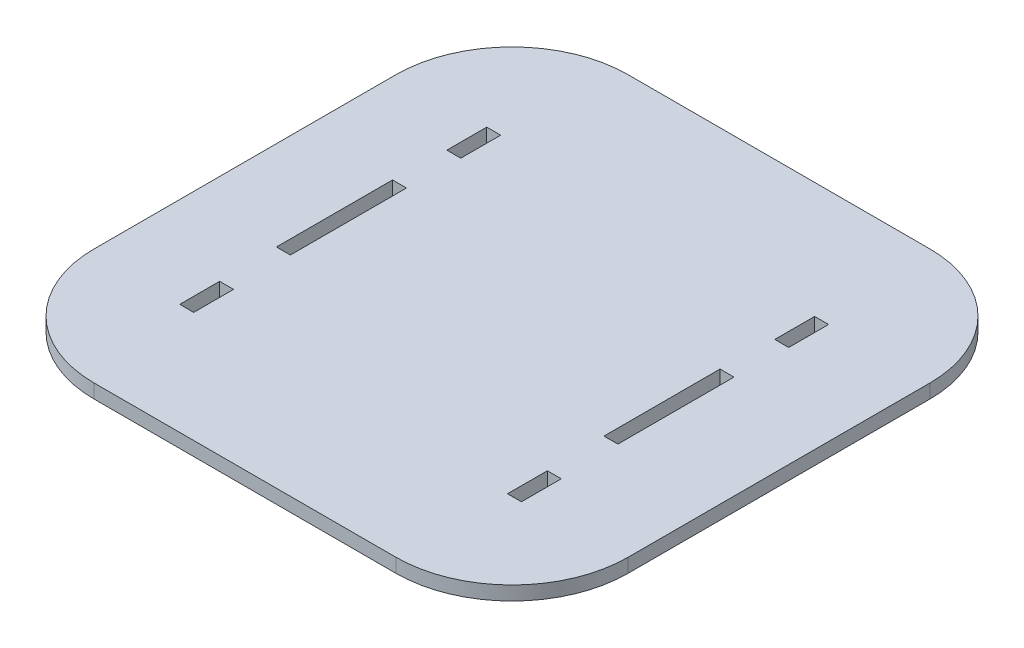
ISO-10303-21;
HEADER;
FILE_DESCRIPTION(('STEP AP214'),'2;1');
FILE_NAME('part.step','',(''),(''),'','','');
FILE_SCHEMA(('AUTOMOTIVE_DESIGN { 1 0 10303 214 1 1 1 1 }'));
ENDSEC;
DATA;
#1=APPLICATION_CONTEXT('core data for automotive mechanical design processes');
#2=APPLICATION_PROTOCOL_DEFINITION('international standard','automotive_design',2000,#1);
#3=PRODUCT_CONTEXT('',#1,'mechanical');
#4=PRODUCT('Part','Part','',(#3));
#5=PRODUCT_RELATED_PRODUCT_CATEGORY('part','',(#4));
#6=PRODUCT_DEFINITION_FORMATION('','',#4);
#7=PRODUCT_DEFINITION_CONTEXT('part definition',#1,'design');
#8=PRODUCT_DEFINITION('design','',#6,#7);
#9=PRODUCT_DEFINITION_SHAPE('','',#8);
#10=(LENGTH_UNIT() NAMED_UNIT(*) SI_UNIT(.MILLI.,.METRE.));
#11=(NAMED_UNIT(*) PLANE_ANGLE_UNIT() SI_UNIT($,.RADIAN.));
#12=(NAMED_UNIT(*) SI_UNIT($,.STERADIAN.) SOLID_ANGLE_UNIT());
#13=UNCERTAINTY_MEASURE_WITH_UNIT(LENGTH_MEASURE(1.E-05),#10,'distance_accuracy_value','');
#14=(GEOMETRIC_REPRESENTATION_CONTEXT(3) GLOBAL_UNCERTAINTY_ASSIGNED_CONTEXT((#13)) GLOBAL_UNIT_ASSIGNED_CONTEXT((#10,
#11,#12)) REPRESENTATION_CONTEXT('',''));
#15=CARTESIAN_POINT('',(0.,0.,0.));
#16=DIRECTION('',(0.,0.,1.));
#17=DIRECTION('',(1.,0.,0.));
#18=AXIS2_PLACEMENT_3D('',#15,#16,#17);
#19=CARTESIAN_POINT('',(61.2708053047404,12.,-315.446866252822));
#20=DIRECTION('',(0.,-1.,0.));
#21=DIRECTION('',(0.,0.,-1.));
#22=AXIS2_PLACEMENT_3D('',#19,#20,#21);
#23=CYLINDRICAL_SURFACE('',#22,100.);
#24=CARTESIAN_POINT('',(61.2708053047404,0.,-315.446866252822));
#25=DIRECTION('',(0.,1.,0.));
#26=DIRECTION('',(0.,0.,-1.));
#27=AXIS2_PLACEMENT_3D('',#24,#25,#26);
#28=CIRCLE('',#27,100.);
#29=CARTESIAN_POINT('',(61.2708053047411,0.,-415.446866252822));
#30=VERTEX_POINT('',#29);
#31=CARTESIAN_POINT('',(-38.7291946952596,0.,-315.446866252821));
#32=VERTEX_POINT('',#31);
#33=EDGE_CURVE('E437',#30,#32,#28,.T.);
#34=ORIENTED_EDGE('',*,*,#33,.T.);
#35=DIRECTION('',(0.,-1.,0.));
#36=VECTOR('',#35,1.);
#37=CARTESIAN_POINT('',(-38.7291946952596,12.,-315.446866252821));
#38=LINE('',#37,#36);
#39=CARTESIAN_POINT('',(-38.7291946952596,12.,-315.446866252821));
#40=VERTEX_POINT('',#39);
#41=EDGE_CURVE('E11',#40,#32,#38,.T.);
#42=ORIENTED_EDGE('',*,*,#41,.F.);
#43=CARTESIAN_POINT('',(61.2708053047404,12.,-315.446866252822));
#44=DIRECTION('',(0.,1.,0.));
#45=DIRECTION('',(0.,0.,-1.));
#46=AXIS2_PLACEMENT_3D('',#43,#44,#45);
#47=CIRCLE('',#46,100.);
#48=CARTESIAN_POINT('',(61.2708053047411,12.,-415.446866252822));
#49=VERTEX_POINT('',#48);
#50=EDGE_CURVE('E438',#49,#40,#47,.T.);
#51=ORIENTED_EDGE('',*,*,#50,.F.);
#52=DIRECTION('',(0.,-1.,0.));
#53=VECTOR('',#52,1.);
#54=CARTESIAN_POINT('',(61.2708053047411,12.,-415.446866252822));
#55=LINE('',#54,#53);
#56=EDGE_CURVE('E456',#49,#30,#55,.T.);
#57=ORIENTED_EDGE('',*,*,#56,.T.);
#58=EDGE_LOOP('',(#34,#42,#51,#57));
#59=FACE_BOUND('',#58,.T.);
#60=ADVANCED_FACE('F32',(#59),#23,.T.);
#61=CARTESIAN_POINT('',(-38.7291946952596,12.,-315.446866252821));
#62=DIRECTION('',(1.,0.,0.));
#63=DIRECTION('',(0.,0.,-1.));
#64=AXIS2_PLACEMENT_3D('',#61,#62,#63);
#65=PLANE('',#64);
#66=DIRECTION('',(0.,0.,1.));
#67=VECTOR('',#66,1.);
#68=CARTESIAN_POINT('',(-38.7291946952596,0.,-315.446866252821));
#69=LINE('',#68,#67);
#70=CARTESIAN_POINT('',(-38.7291946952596,0.,-55.4468662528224));
#71=VERTEX_POINT('',#70);
#72=EDGE_CURVE('E459',#32,#71,#69,.T.);
#73=ORIENTED_EDGE('',*,*,#72,.T.);
#74=DIRECTION('',(0.,-1.,0.));
#75=VECTOR('',#74,1.);
#76=CARTESIAN_POINT('',(-38.7291946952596,12.,-55.4468662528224));
#77=LINE('',#76,#75);
#78=CARTESIAN_POINT('',(-38.7291946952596,12.,-55.4468662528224));
#79=VERTEX_POINT('',#78);
#80=EDGE_CURVE('E39',#79,#71,#77,.T.);
#81=ORIENTED_EDGE('',*,*,#80,.F.);
#82=DIRECTION('',(0.,0.,1.));
#83=VECTOR('',#82,1.);
#84=CARTESIAN_POINT('',(-38.7291946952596,12.,-315.446866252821));
#85=LINE('',#84,#83);
#86=EDGE_CURVE('E441',#40,#79,#85,.T.);
#87=ORIENTED_EDGE('',*,*,#86,.F.);
#88=ORIENTED_EDGE('',*,*,#41,.T.);
#89=EDGE_LOOP('',(#73,#81,#87,#88));
#90=FACE_BOUND('',#89,.T.);
#91=ADVANCED_FACE('F515',(#90),#65,.F.);
#92=CARTESIAN_POINT('',(61.2708053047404,12.,-55.4468662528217));
#93=DIRECTION('',(0.,-1.,0.));
#94=DIRECTION('',(0.,0.,-1.));
#95=AXIS2_PLACEMENT_3D('',#92,#93,#94);
#96=CYLINDRICAL_SURFACE('',#95,100.);
#97=CARTESIAN_POINT('',(61.2708053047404,0.,-55.4468662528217));
#98=DIRECTION('',(0.,1.,0.));
#99=DIRECTION('',(0.,0.,-1.));
#100=AXIS2_PLACEMENT_3D('',#97,#98,#99);
#101=CIRCLE('',#100,100.);
#102=CARTESIAN_POINT('',(61.2708053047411,0.,44.5531337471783));
#103=VERTEX_POINT('',#102);
#104=EDGE_CURVE('E461',#71,#103,#101,.T.);
#105=ORIENTED_EDGE('',*,*,#104,.T.);
#106=DIRECTION('',(0.,-1.,0.));
#107=VECTOR('',#106,1.);
#108=CARTESIAN_POINT('',(61.2708053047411,12.,44.5531337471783));
#109=LINE('',#108,#107);
#110=CARTESIAN_POINT('',(61.2708053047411,12.,44.5531337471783));
#111=VERTEX_POINT('',#110);
#112=EDGE_CURVE('E486',#111,#103,#109,.T.);
#113=ORIENTED_EDGE('',*,*,#112,.F.);
#114=CARTESIAN_POINT('',(61.2708053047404,12.,-55.4468662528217));
#115=DIRECTION('',(0.,1.,0.));
#116=DIRECTION('',(0.,0.,-1.));
#117=AXIS2_PLACEMENT_3D('',#114,#115,#116);
#118=CIRCLE('',#117,100.);
#119=EDGE_CURVE('E444',#79,#111,#118,.T.);
#120=ORIENTED_EDGE('',*,*,#119,.F.);
#121=ORIENTED_EDGE('',*,*,#80,.T.);
#122=EDGE_LOOP('',(#105,#113,#120,#121));
#123=FACE_BOUND('',#122,.T.);
#124=ADVANCED_FACE('F493',(#123),#96,.T.);
#125=CARTESIAN_POINT('',(61.2708053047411,12.,44.5531337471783));
#126=DIRECTION('',(0.,0.,-1.));
#127=DIRECTION('',(-1.,0.,0.));
#128=AXIS2_PLACEMENT_3D('',#125,#126,#127);
#129=PLANE('',#128);
#130=DIRECTION('',(1.,0.,0.));
#131=VECTOR('',#130,1.);
#132=CARTESIAN_POINT('',(61.2708053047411,0.,44.5531337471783));
#133=LINE('',#132,#131);
#134=CARTESIAN_POINT('',(321.27080530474,0.,44.5531337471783));
#135=VERTEX_POINT('',#134);
#136=EDGE_CURVE('E463',#103,#135,#133,.T.);
#137=ORIENTED_EDGE('',*,*,#136,.T.);
#138=DIRECTION('',(0.,-1.,0.));
#139=VECTOR('',#138,1.);
#140=CARTESIAN_POINT('',(321.27080530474,12.,44.5531337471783));
#141=LINE('',#140,#139);
#142=CARTESIAN_POINT('',(321.27080530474,12.,44.5531337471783));
#143=VERTEX_POINT('',#142);
#144=EDGE_CURVE('E483',#143,#135,#141,.T.);
#145=ORIENTED_EDGE('',*,*,#144,.F.);
#146=DIRECTION('',(1.,0.,0.));
#147=VECTOR('',#146,1.);
#148=CARTESIAN_POINT('',(61.2708053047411,12.,44.5531337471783));
#149=LINE('',#148,#147);
#150=EDGE_CURVE('E446',#111,#143,#149,.T.);
#151=ORIENTED_EDGE('',*,*,#150,.F.);
#152=ORIENTED_EDGE('',*,*,#112,.T.);
#153=EDGE_LOOP('',(#137,#145,#151,#152));
#154=FACE_BOUND('',#153,.T.);
#155=ADVANCED_FACE('F503',(#154),#129,.F.);
#156=CARTESIAN_POINT('',(321.27080530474,12.,-55.4468662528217));
#157=DIRECTION('',(0.,-1.,0.));
#158=DIRECTION('',(0.,0.,-1.));
#159=AXIS2_PLACEMENT_3D('',#156,#157,#158);
#160=CYLINDRICAL_SURFACE('',#159,100.);
#161=CARTESIAN_POINT('',(321.27080530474,0.,-55.4468662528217));
#162=DIRECTION('',(0.,1.,0.));
#163=DIRECTION('',(0.,0.,1.));
#164=AXIS2_PLACEMENT_3D('',#161,#162,#163);
#165=CIRCLE('',#164,100.);
#166=CARTESIAN_POINT('',(421.27080530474,0.,-55.4468662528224));
#167=VERTEX_POINT('',#166);
#168=EDGE_CURVE('E465',#135,#167,#165,.T.);
#169=ORIENTED_EDGE('',*,*,#168,.T.);
#170=DIRECTION('',(0.,-1.,0.));
#171=VECTOR('',#170,1.);
#172=CARTESIAN_POINT('',(421.27080530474,12.,-55.4468662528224));
#173=LINE('',#172,#171);
#174=CARTESIAN_POINT('',(421.27080530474,12.,-55.4468662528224));
#175=VERTEX_POINT('',#174);
#176=EDGE_CURVE('E480',#175,#167,#173,.T.);
#177=ORIENTED_EDGE('',*,*,#176,.F.);
#178=CARTESIAN_POINT('',(321.27080530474,12.,-55.4468662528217));
#179=DIRECTION('',(0.,1.,0.));
#180=DIRECTION('',(0.,0.,1.));
#181=AXIS2_PLACEMENT_3D('',#178,#179,#180);
#182=CIRCLE('',#181,100.);
#183=EDGE_CURVE('E448',#143,#175,#182,.T.);
#184=ORIENTED_EDGE('',*,*,#183,.F.);
#185=ORIENTED_EDGE('',*,*,#144,.T.);
#186=EDGE_LOOP('',(#169,#177,#184,#185));
#187=FACE_BOUND('',#186,.T.);
#188=ADVANCED_FACE('F507',(#187),#160,.T.);
#189=CARTESIAN_POINT('',(421.27080530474,12.,-315.446866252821));
#190=DIRECTION('',(-1.,0.,0.));
#191=DIRECTION('',(0.,0.,1.));
#192=AXIS2_PLACEMENT_3D('',#189,#190,#191);
#193=PLANE('',#192);
#194=DIRECTION('',(0.,0.,-1.));
#195=VECTOR('',#194,1.);
#196=CARTESIAN_POINT('',(421.27080530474,0.,-315.446866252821));
#197=LINE('',#196,#195);
#198=CARTESIAN_POINT('',(421.27080530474,0.,-315.446866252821));
#199=VERTEX_POINT('',#198);
#200=EDGE_CURVE('E467',#167,#199,#197,.T.);
#201=ORIENTED_EDGE('',*,*,#200,.T.);
#202=DIRECTION('',(0.,-1.,0.));
#203=VECTOR('',#202,1.);
#204=CARTESIAN_POINT('',(421.27080530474,12.,-315.446866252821));
#205=LINE('',#204,#203);
#206=CARTESIAN_POINT('',(421.27080530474,12.,-315.446866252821));
#207=VERTEX_POINT('',#206);
#208=EDGE_CURVE('E477',#207,#199,#205,.T.);
#209=ORIENTED_EDGE('',*,*,#208,.F.);
#210=DIRECTION('',(0.,0.,-1.));
#211=VECTOR('',#210,1.);
#212=CARTESIAN_POINT('',(421.27080530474,12.,-315.446866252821));
#213=LINE('',#212,#211);
#214=EDGE_CURVE('E450',#175,#207,#213,.T.);
#215=ORIENTED_EDGE('',*,*,#214,.F.);
#216=ORIENTED_EDGE('',*,*,#176,.T.);
#217=EDGE_LOOP('',(#201,#209,#215,#216));
#218=FACE_BOUND('',#217,.T.);
#219=ADVANCED_FACE('F528',(#218),#193,.F.);
#220=CARTESIAN_POINT('',(321.27080530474,12.,-315.446866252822));
#221=DIRECTION('',(0.,-1.,0.));
#222=DIRECTION('',(0.,0.,-1.));
#223=AXIS2_PLACEMENT_3D('',#220,#221,#222);
#224=CYLINDRICAL_SURFACE('',#223,100.);
#225=CARTESIAN_POINT('',(321.27080530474,0.,-315.446866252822));
#226=DIRECTION('',(0.,1.,0.));
#227=DIRECTION('',(0.,0.,1.));
#228=AXIS2_PLACEMENT_3D('',#225,#226,#227);
#229=CIRCLE('',#228,100.);
#230=CARTESIAN_POINT('',(321.27080530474,0.,-415.446866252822));
#231=VERTEX_POINT('',#230);
#232=EDGE_CURVE('E469',#199,#231,#229,.T.);
#233=ORIENTED_EDGE('',*,*,#232,.T.);
#234=DIRECTION('',(0.,-1.,0.));
#235=VECTOR('',#234,1.);
#236=CARTESIAN_POINT('',(321.27080530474,12.,-415.446866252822));
#237=LINE('',#236,#235);
#238=CARTESIAN_POINT('',(321.27080530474,12.,-415.446866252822));
#239=VERTEX_POINT('',#238);
#240=EDGE_CURVE('E474',#239,#231,#237,.T.);
#241=ORIENTED_EDGE('',*,*,#240,.F.);
#242=CARTESIAN_POINT('',(321.27080530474,12.,-315.446866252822));
#243=DIRECTION('',(0.,1.,0.));
#244=DIRECTION('',(0.,0.,1.));
#245=AXIS2_PLACEMENT_3D('',#242,#243,#244);
#246=CIRCLE('',#245,100.);
#247=EDGE_CURVE('E452',#207,#239,#246,.T.);
#248=ORIENTED_EDGE('',*,*,#247,.F.);
#249=ORIENTED_EDGE('',*,*,#208,.T.);
#250=EDGE_LOOP('',(#233,#241,#248,#249));
#251=FACE_BOUND('',#250,.T.);
#252=ADVANCED_FACE('F526',(#251),#224,.T.);
#253=CARTESIAN_POINT('',(61.2708053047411,12.,-415.446866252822));
#254=DIRECTION('',(0.,0.,1.));
#255=DIRECTION('',(1.,0.,0.));
#256=AXIS2_PLACEMENT_3D('',#253,#254,#255);
#257=PLANE('',#256);
#258=DIRECTION('',(-1.,0.,0.));
#259=VECTOR('',#258,1.);
#260=CARTESIAN_POINT('',(61.2708053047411,0.,-415.446866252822));
#261=LINE('',#260,#259);
#262=EDGE_CURVE('E442',#231,#30,#261,.T.);
#263=ORIENTED_EDGE('',*,*,#262,.T.);
#264=ORIENTED_EDGE('',*,*,#56,.F.);
#265=DIRECTION('',(-1.,0.,0.));
#266=VECTOR('',#265,1.);
#267=CARTESIAN_POINT('',(61.2708053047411,12.,-415.446866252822));
#268=LINE('',#267,#266);
#269=EDGE_CURVE('E454',#239,#49,#268,.T.);
#270=ORIENTED_EDGE('',*,*,#269,.F.);
#271=ORIENTED_EDGE('',*,*,#240,.T.);
#272=EDGE_LOOP('',(#263,#264,#270,#271));
#273=FACE_BOUND('',#272,.T.);
#274=ADVANCED_FACE('F521',(#273),#257,.F.);
#275=CARTESIAN_POINT('',(61.2708053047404,12.,-315.446866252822));
#276=DIRECTION('',(0.,-1.,0.));
#277=DIRECTION('',(0.,0.,-1.));
#278=AXIS2_PLACEMENT_3D('',#275,#276,#277);
#279=PLANE('',#278);
#280=DIRECTION('',(0.,0.,-1.));
#281=VECTOR('',#280,1.);
#282=CARTESIAN_POINT('',(332.487286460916,12.,-235.446866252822));
#283=LINE('',#282,#281);
#284=CARTESIAN_POINT('',(332.487286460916,12.,-135.446866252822));
#285=VERTEX_POINT('',#284);
#286=CARTESIAN_POINT('',(332.487286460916,12.,-235.446866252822));
#287=VERTEX_POINT('',#286);
#288=EDGE_CURVE('E264',#285,#287,#283,.T.);
#289=ORIENTED_EDGE('',*,*,#288,.F.);
#290=DIRECTION('',(1.,0.,0.));
#291=VECTOR('',#290,1.);
#292=CARTESIAN_POINT('',(332.487286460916,12.,-135.446866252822));
#293=LINE('',#292,#291);
#294=CARTESIAN_POINT('',(320.487286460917,12.,-135.446866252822));
#295=VERTEX_POINT('',#294);
#296=EDGE_CURVE('E257',#295,#285,#293,.T.);
#297=ORIENTED_EDGE('',*,*,#296,.F.);
#298=DIRECTION('',(0.,0.,1.));
#299=VECTOR('',#298,1.);
#300=CARTESIAN_POINT('',(320.487286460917,12.,-235.446866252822));
#301=LINE('',#300,#299);
#302=CARTESIAN_POINT('',(320.487286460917,12.,-235.446866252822));
#303=VERTEX_POINT('',#302);
#304=EDGE_CURVE('E268',#303,#295,#301,.T.);
#305=ORIENTED_EDGE('',*,*,#304,.F.);
#306=DIRECTION('',(-1.,0.,0.));
#307=VECTOR('',#306,1.);
#308=CARTESIAN_POINT('',(320.487286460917,12.,-235.446866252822));
#309=LINE('',#308,#307);
#310=EDGE_CURVE('E46',#287,#303,#309,.T.);
#311=ORIENTED_EDGE('',*,*,#310,.F.);
#312=EDGE_LOOP('',(#289,#297,#305,#311));
#313=FACE_BOUND('',#312,.T.);
#314=DIRECTION('',(0.,0.,-1.));
#315=VECTOR('',#314,1.);
#316=CARTESIAN_POINT('',(50.3494203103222,12.,-235.446866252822));
#317=LINE('',#316,#315);
#318=CARTESIAN_POINT('',(50.3494203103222,12.,-135.446866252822));
#319=VERTEX_POINT('',#318);
#320=CARTESIAN_POINT('',(50.3494203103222,12.,-235.446866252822));
#321=VERTEX_POINT('',#320);
#322=EDGE_CURVE('E281',#319,#321,#317,.T.);
#323=ORIENTED_EDGE('',*,*,#322,.F.);
#324=DIRECTION('',(1.,0.,0.));
#325=VECTOR('',#324,1.);
#326=CARTESIAN_POINT('',(50.3494203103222,12.,-135.446866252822));
#327=LINE('',#326,#325);
#328=CARTESIAN_POINT('',(38.3494203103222,12.,-135.446866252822));
#329=VERTEX_POINT('',#328);
#330=EDGE_CURVE('E284',#329,#319,#327,.T.);
#331=ORIENTED_EDGE('',*,*,#330,.F.);
#332=DIRECTION('',(0.,0.,1.));
#333=VECTOR('',#332,1.);
#334=CARTESIAN_POINT('',(38.3494203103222,12.,-235.446866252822));
#335=LINE('',#334,#333);
#336=CARTESIAN_POINT('',(38.3494203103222,12.,-235.446866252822));
#337=VERTEX_POINT('',#336);
#338=EDGE_CURVE('E277',#337,#329,#335,.T.);
#339=ORIENTED_EDGE('',*,*,#338,.F.);
#340=DIRECTION('',(-1.,0.,0.));
#341=VECTOR('',#340,1.);
#342=CARTESIAN_POINT('',(38.3494203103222,12.,-235.446866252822));
#343=LINE('',#342,#341);
#344=EDGE_CURVE('E278',#321,#337,#343,.T.);
#345=ORIENTED_EDGE('',*,*,#344,.F.);
#346=EDGE_LOOP('',(#323,#331,#339,#345));
#347=FACE_BOUND('',#346,.T.);
#348=DIRECTION('',(-0.999999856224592,0.,-0.000536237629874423));
#349=VECTOR('',#348,1.);
#350=CARTESIAN_POINT('',(39.5071365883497,12.,-85.3704290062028));
#351=LINE('',#350,#349);
#352=CARTESIAN_POINT('',(51.5071365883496,12.,-85.3639941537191));
#353=VERTEX_POINT('',#352);
#354=CARTESIAN_POINT('',(39.5071365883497,12.,-85.3704290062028));
#355=VERTEX_POINT('',#354);
#356=EDGE_CURVE('E313',#353,#355,#351,.T.);
#357=ORIENTED_EDGE('',*,*,#356,.F.);
#358=DIRECTION('',(0.,0.,-1.));
#359=VECTOR('',#358,1.);
#360=CARTESIAN_POINT('',(51.5071365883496,12.,-51.0206059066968));
#361=LINE('',#360,#359);
#362=CARTESIAN_POINT('',(51.5071365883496,12.,-51.0206059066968));
#363=VERTEX_POINT('',#362);
#364=EDGE_CURVE('E316',#363,#353,#361,.T.);
#365=ORIENTED_EDGE('',*,*,#364,.F.);
#366=DIRECTION('',(1.,0.,0.));
#367=VECTOR('',#366,1.);
#368=CARTESIAN_POINT('',(39.5071365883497,12.,-51.0206059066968));
#369=LINE('',#368,#367);
#370=CARTESIAN_POINT('',(39.5071365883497,12.,-51.0206059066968));
#371=VERTEX_POINT('',#370);
#372=EDGE_CURVE('E319',#371,#363,#369,.T.);
#373=ORIENTED_EDGE('',*,*,#372,.F.);
#374=DIRECTION('',(0.,0.,1.));
#375=VECTOR('',#374,1.);
#376=CARTESIAN_POINT('',(39.5071365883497,12.,-85.3704290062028));
#377=LINE('',#376,#375);
#378=EDGE_CURVE('E310',#355,#371,#377,.T.);
#379=ORIENTED_EDGE('',*,*,#378,.F.);
#380=EDGE_LOOP('',(#357,#365,#373,#379));
#381=FACE_BOUND('',#380,.T.);
#382=DIRECTION('',(0.,0.,1.));
#383=VECTOR('',#382,1.);
#384=CARTESIAN_POINT('',(321.97276887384,12.,-315.446866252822));
#385=LINE('',#384,#383);
#386=CARTESIAN_POINT('',(321.97276887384,12.,-315.446866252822));
#387=VERTEX_POINT('',#386);
#388=CARTESIAN_POINT('',(321.97276887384,12.,-281.103463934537));
#389=VERTEX_POINT('',#388);
#390=EDGE_CURVE('E347',#387,#389,#385,.T.);
#391=ORIENTED_EDGE('',*,*,#390,.F.);
#392=DIRECTION('',(-1.,0.,0.));
#393=VECTOR('',#392,1.);
#394=CARTESIAN_POINT('',(321.97276887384,12.,-315.446866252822));
#395=LINE('',#394,#393);
#396=CARTESIAN_POINT('',(333.97276887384,12.,-315.446866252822));
#397=VERTEX_POINT('',#396);
#398=EDGE_CURVE('E350',#397,#387,#395,.T.);
#399=ORIENTED_EDGE('',*,*,#398,.F.);
#400=DIRECTION('',(0.,0.,-1.));
#401=VECTOR('',#400,1.);
#402=CARTESIAN_POINT('',(333.97276887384,12.,-281.103463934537));
#403=LINE('',#402,#401);
#404=CARTESIAN_POINT('',(333.97276887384,12.,-281.103463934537));
#405=VERTEX_POINT('',#404);
#406=EDGE_CURVE('E353',#405,#397,#403,.T.);
#407=ORIENTED_EDGE('',*,*,#406,.F.);
#408=DIRECTION('',(1.,0.,0.));
#409=VECTOR('',#408,1.);
#410=CARTESIAN_POINT('',(321.97276887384,12.,-281.103463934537));
#411=LINE('',#410,#409);
#412=EDGE_CURVE('E344',#389,#405,#411,.T.);
#413=ORIENTED_EDGE('',*,*,#412,.F.);
#414=EDGE_LOOP('',(#391,#399,#407,#413));
#415=FACE_BOUND('',#414,.T.);
#416=DIRECTION('',(-0.999999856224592,0.,-0.000536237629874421));
#417=VECTOR('',#416,1.);
#418=CARTESIAN_POINT('',(321.97276887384,12.,-85.2189602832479));
#419=LINE('',#418,#417);
#420=CARTESIAN_POINT('',(333.97276887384,12.,-85.2125254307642));
#421=VERTEX_POINT('',#420);
#422=CARTESIAN_POINT('',(321.97276887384,12.,-85.2189602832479));
#423=VERTEX_POINT('',#422);
#424=EDGE_CURVE('E379',#421,#423,#419,.T.);
#425=ORIENTED_EDGE('',*,*,#424,.F.);
#426=DIRECTION('',(0.,0.,-1.));
#427=VECTOR('',#426,1.);
#428=CARTESIAN_POINT('',(333.97276887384,12.,-50.8755720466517));
#429=LINE('',#428,#427);
#430=CARTESIAN_POINT('',(333.97276887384,12.,-50.8755720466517));
#431=VERTEX_POINT('',#430);
#432=EDGE_CURVE('E382',#431,#421,#429,.T.);
#433=ORIENTED_EDGE('',*,*,#432,.F.);
#434=DIRECTION('',(1.,0.,0.));
#435=VECTOR('',#434,1.);
#436=CARTESIAN_POINT('',(321.97276887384,12.,-50.8755720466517));
#437=LINE('',#436,#435);
#438=CARTESIAN_POINT('',(321.97276887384,12.,-50.8755720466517));
#439=VERTEX_POINT('',#438);
#440=EDGE_CURVE('E309',#439,#431,#437,.T.);
#441=ORIENTED_EDGE('',*,*,#440,.F.);
#442=DIRECTION('',(0.,0.,1.));
#443=VECTOR('',#442,1.);
#444=CARTESIAN_POINT('',(321.97276887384,12.,-85.2189602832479));
#445=LINE('',#444,#443);
#446=EDGE_CURVE('E376',#423,#439,#445,.T.);
#447=ORIENTED_EDGE('',*,*,#446,.F.);
#448=EDGE_LOOP('',(#425,#433,#441,#447));
#449=FACE_BOUND('',#448,.T.);
#450=DIRECTION('',(0.,0.,1.));
#451=VECTOR('',#450,1.);
#452=CARTESIAN_POINT('',(39.5071365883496,12.,-315.446866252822));
#453=LINE('',#452,#451);
#454=CARTESIAN_POINT('',(39.5071365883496,12.,-315.446866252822));
#455=VERTEX_POINT('',#454);
#456=CARTESIAN_POINT('',(39.5071365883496,12.,-281.103463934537));
#457=VERTEX_POINT('',#456);
#458=EDGE_CURVE('E409',#455,#457,#453,.T.);
#459=ORIENTED_EDGE('',*,*,#458,.F.);
#460=DIRECTION('',(-1.,0.,0.));
#461=VECTOR('',#460,1.);
#462=CARTESIAN_POINT('',(39.5071365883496,12.,-315.446866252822));
#463=LINE('',#462,#461);
#464=CARTESIAN_POINT('',(51.5071365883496,12.,-315.446866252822));
#465=VERTEX_POINT('',#464);
#466=EDGE_CURVE('E412',#465,#455,#463,.T.);
#467=ORIENTED_EDGE('',*,*,#466,.F.);
#468=DIRECTION('',(0.,0.,-1.));
#469=VECTOR('',#468,1.);
#470=CARTESIAN_POINT('',(51.5071365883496,12.,-281.103463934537));
#471=LINE('',#470,#469);
#472=CARTESIAN_POINT('',(51.5071365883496,12.,-281.103463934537));
#473=VERTEX_POINT('',#472);
#474=EDGE_CURVE('E343',#473,#465,#471,.T.);
#475=ORIENTED_EDGE('',*,*,#474,.F.);
#476=DIRECTION('',(1.,0.,0.));
#477=VECTOR('',#476,1.);
#478=CARTESIAN_POINT('',(39.5071365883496,12.,-281.103463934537));
#479=LINE('',#478,#477);
#480=EDGE_CURVE('E406',#457,#473,#479,.T.);
#481=ORIENTED_EDGE('',*,*,#480,.F.);
#482=EDGE_LOOP('',(#459,#467,#475,#481));
#483=FACE_BOUND('',#482,.T.);
#484=ORIENTED_EDGE('',*,*,#50,.T.);
#485=ORIENTED_EDGE('',*,*,#86,.T.);
#486=ORIENTED_EDGE('',*,*,#119,.T.);
#487=ORIENTED_EDGE('',*,*,#150,.T.);
#488=ORIENTED_EDGE('',*,*,#183,.T.);
#489=ORIENTED_EDGE('',*,*,#214,.T.);
#490=ORIENTED_EDGE('',*,*,#247,.T.);
#491=ORIENTED_EDGE('',*,*,#269,.T.);
#492=EDGE_LOOP('',(#484,#485,#486,#487,#488,#489,#490,#491));
#493=FACE_BOUND('',#492,.T.);
#494=ADVANCED_FACE('F511',(#313,#347,#381,#415,#449,#483,#493),#279,.F.);
#495=CARTESIAN_POINT('',(61.2708053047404,0.,-315.446866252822));
#496=DIRECTION('',(0.,-1.,0.));
#497=DIRECTION('',(0.,0.,-1.));
#498=AXIS2_PLACEMENT_3D('',#495,#496,#497);
#499=PLANE('',#498);
#500=DIRECTION('',(1.,0.,0.));
#501=VECTOR('',#500,1.);
#502=CARTESIAN_POINT('',(332.487286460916,0.,-135.446866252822));
#503=LINE('',#502,#501);
#504=CARTESIAN_POINT('',(320.487286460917,0.,-135.446866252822));
#505=VERTEX_POINT('',#504);
#506=CARTESIAN_POINT('',(332.487286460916,0.,-135.446866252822));
#507=VERTEX_POINT('',#506);
#508=EDGE_CURVE('E254',#505,#507,#503,.T.);
#509=ORIENTED_EDGE('',*,*,#508,.T.);
#510=DIRECTION('',(0.,0.,-1.));
#511=VECTOR('',#510,1.);
#512=CARTESIAN_POINT('',(332.487286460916,0.,-235.446866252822));
#513=LINE('',#512,#511);
#514=CARTESIAN_POINT('',(332.487286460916,0.,-235.446866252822));
#515=VERTEX_POINT('',#514);
#516=EDGE_CURVE('E241',#507,#515,#513,.T.);
#517=ORIENTED_EDGE('',*,*,#516,.T.);
#518=DIRECTION('',(-1.,0.,0.));
#519=VECTOR('',#518,1.);
#520=CARTESIAN_POINT('',(320.487286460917,0.,-235.446866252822));
#521=LINE('',#520,#519);
#522=CARTESIAN_POINT('',(320.487286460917,0.,-235.446866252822));
#523=VERTEX_POINT('',#522);
#524=EDGE_CURVE('E272',#515,#523,#521,.T.);
#525=ORIENTED_EDGE('',*,*,#524,.T.);
#526=DIRECTION('',(0.,0.,1.));
#527=VECTOR('',#526,1.);
#528=CARTESIAN_POINT('',(320.487286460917,0.,-235.446866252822));
#529=LINE('',#528,#527);
#530=EDGE_CURVE('E262',#523,#505,#529,.T.);
#531=ORIENTED_EDGE('',*,*,#530,.T.);
#532=EDGE_LOOP('',(#509,#517,#525,#531));
#533=FACE_BOUND('',#532,.T.);
#534=DIRECTION('',(1.,0.,0.));
#535=VECTOR('',#534,1.);
#536=CARTESIAN_POINT('',(50.3494203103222,0.,-135.446866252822));
#537=LINE('',#536,#535);
#538=CARTESIAN_POINT('',(38.3494203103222,0.,-135.446866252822));
#539=VERTEX_POINT('',#538);
#540=CARTESIAN_POINT('',(50.3494203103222,0.,-135.446866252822));
#541=VERTEX_POINT('',#540);
#542=EDGE_CURVE('E280',#539,#541,#537,.T.);
#543=ORIENTED_EDGE('',*,*,#542,.T.);
#544=DIRECTION('',(0.,0.,-1.));
#545=VECTOR('',#544,1.);
#546=CARTESIAN_POINT('',(50.3494203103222,0.,-235.446866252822));
#547=LINE('',#546,#545);
#548=CARTESIAN_POINT('',(50.3494203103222,0.,-235.446866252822));
#549=VERTEX_POINT('',#548);
#550=EDGE_CURVE('E301',#541,#549,#547,.T.);
#551=ORIENTED_EDGE('',*,*,#550,.T.);
#552=DIRECTION('',(-1.,0.,0.));
#553=VECTOR('',#552,1.);
#554=CARTESIAN_POINT('',(38.3494203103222,0.,-235.446866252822));
#555=LINE('',#554,#553);
#556=CARTESIAN_POINT('',(38.3494203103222,0.,-235.446866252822));
#557=VERTEX_POINT('',#556);
#558=EDGE_CURVE('E297',#549,#557,#555,.T.);
#559=ORIENTED_EDGE('',*,*,#558,.T.);
#560=DIRECTION('',(0.,0.,1.));
#561=VECTOR('',#560,1.);
#562=CARTESIAN_POINT('',(38.3494203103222,0.,-235.446866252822));
#563=LINE('',#562,#561);
#564=EDGE_CURVE('E292',#557,#539,#563,.T.);
#565=ORIENTED_EDGE('',*,*,#564,.T.);
#566=EDGE_LOOP('',(#543,#551,#559,#565));
#567=FACE_BOUND('',#566,.T.);
#568=DIRECTION('',(0.,0.,-1.));
#569=VECTOR('',#568,1.);
#570=CARTESIAN_POINT('',(51.5071365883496,0.,-51.0206059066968));
#571=LINE('',#570,#569);
#572=CARTESIAN_POINT('',(51.5071365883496,0.,-51.0206059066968));
#573=VERTEX_POINT('',#572);
#574=CARTESIAN_POINT('',(51.5071365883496,0.,-85.3639941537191));
#575=VERTEX_POINT('',#574);
#576=EDGE_CURVE('E312',#573,#575,#571,.T.);
#577=ORIENTED_EDGE('',*,*,#576,.T.);
#578=DIRECTION('',(-0.999999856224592,0.,-0.000536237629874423));
#579=VECTOR('',#578,1.);
#580=CARTESIAN_POINT('',(39.5071365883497,0.,-85.3704290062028));
#581=LINE('',#580,#579);
#582=CARTESIAN_POINT('',(39.5071365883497,0.,-85.3704290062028));
#583=VERTEX_POINT('',#582);
#584=EDGE_CURVE('E335',#575,#583,#581,.T.);
#585=ORIENTED_EDGE('',*,*,#584,.T.);
#586=DIRECTION('',(0.,0.,1.));
#587=VECTOR('',#586,1.);
#588=CARTESIAN_POINT('',(39.5071365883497,0.,-85.3704290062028));
#589=LINE('',#588,#587);
#590=CARTESIAN_POINT('',(39.5071365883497,0.,-51.0206059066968));
#591=VERTEX_POINT('',#590);
#592=EDGE_CURVE('E331',#583,#591,#589,.T.);
#593=ORIENTED_EDGE('',*,*,#592,.T.);
#594=DIRECTION('',(1.,0.,0.));
#595=VECTOR('',#594,1.);
#596=CARTESIAN_POINT('',(39.5071365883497,0.,-51.0206059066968));
#597=LINE('',#596,#595);
#598=EDGE_CURVE('E326',#591,#573,#597,.T.);
#599=ORIENTED_EDGE('',*,*,#598,.T.);
#600=EDGE_LOOP('',(#577,#585,#593,#599));
#601=FACE_BOUND('',#600,.T.);
#602=DIRECTION('',(-1.,0.,0.));
#603=VECTOR('',#602,1.);
#604=CARTESIAN_POINT('',(321.97276887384,0.,-315.446866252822));
#605=LINE('',#604,#603);
#606=CARTESIAN_POINT('',(333.97276887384,0.,-315.446866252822));
#607=VERTEX_POINT('',#606);
#608=CARTESIAN_POINT('',(321.97276887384,0.,-315.446866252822));
#609=VERTEX_POINT('',#608);
#610=EDGE_CURVE('E346',#607,#609,#605,.T.);
#611=ORIENTED_EDGE('',*,*,#610,.T.);
#612=DIRECTION('',(0.,0.,1.));
#613=VECTOR('',#612,1.);
#614=CARTESIAN_POINT('',(321.97276887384,0.,-315.446866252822));
#615=LINE('',#614,#613);
#616=CARTESIAN_POINT('',(321.97276887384,0.,-281.103463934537));
#617=VERTEX_POINT('',#616);
#618=EDGE_CURVE('E368',#609,#617,#615,.T.);
#619=ORIENTED_EDGE('',*,*,#618,.T.);
#620=DIRECTION('',(1.,0.,0.));
#621=VECTOR('',#620,1.);
#622=CARTESIAN_POINT('',(321.97276887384,0.,-281.103463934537));
#623=LINE('',#622,#621);
#624=CARTESIAN_POINT('',(333.97276887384,0.,-281.103463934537));
#625=VERTEX_POINT('',#624);
#626=EDGE_CURVE('E364',#617,#625,#623,.T.);
#627=ORIENTED_EDGE('',*,*,#626,.T.);
#628=DIRECTION('',(0.,0.,-1.));
#629=VECTOR('',#628,1.);
#630=CARTESIAN_POINT('',(333.97276887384,0.,-281.103463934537));
#631=LINE('',#630,#629);
#632=EDGE_CURVE('E360',#625,#607,#631,.T.);
#633=ORIENTED_EDGE('',*,*,#632,.T.);
#634=EDGE_LOOP('',(#611,#619,#627,#633));
#635=FACE_BOUND('',#634,.T.);
#636=DIRECTION('',(0.,0.,-1.));
#637=VECTOR('',#636,1.);
#638=CARTESIAN_POINT('',(333.97276887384,0.,-50.8755720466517));
#639=LINE('',#638,#637);
#640=CARTESIAN_POINT('',(333.97276887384,0.,-50.8755720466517));
#641=VERTEX_POINT('',#640);
#642=CARTESIAN_POINT('',(333.97276887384,0.,-85.2125254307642));
#643=VERTEX_POINT('',#642);
#644=EDGE_CURVE('E378',#641,#643,#639,.T.);
#645=ORIENTED_EDGE('',*,*,#644,.T.);
#646=DIRECTION('',(-0.999999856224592,0.,-0.000536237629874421));
#647=VECTOR('',#646,1.);
#648=CARTESIAN_POINT('',(321.97276887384,0.,-85.2189602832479));
#649=LINE('',#648,#647);
#650=CARTESIAN_POINT('',(321.97276887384,0.,-85.2189602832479));
#651=VERTEX_POINT('',#650);
#652=EDGE_CURVE('E398',#643,#651,#649,.T.);
#653=ORIENTED_EDGE('',*,*,#652,.T.);
#654=DIRECTION('',(0.,0.,1.));
#655=VECTOR('',#654,1.);
#656=CARTESIAN_POINT('',(321.97276887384,0.,-85.2189602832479));
#657=LINE('',#656,#655);
#658=CARTESIAN_POINT('',(321.97276887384,0.,-50.8755720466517));
#659=VERTEX_POINT('',#658);
#660=EDGE_CURVE('E394',#651,#659,#657,.T.);
#661=ORIENTED_EDGE('',*,*,#660,.T.);
#662=DIRECTION('',(1.,0.,0.));
#663=VECTOR('',#662,1.);
#664=CARTESIAN_POINT('',(321.97276887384,0.,-50.8755720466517));
#665=LINE('',#664,#663);
#666=EDGE_CURVE('E390',#659,#641,#665,.T.);
#667=ORIENTED_EDGE('',*,*,#666,.T.);
#668=EDGE_LOOP('',(#645,#653,#661,#667));
#669=FACE_BOUND('',#668,.T.);
#670=DIRECTION('',(-1.,0.,0.));
#671=VECTOR('',#670,1.);
#672=CARTESIAN_POINT('',(39.5071365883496,0.,-315.446866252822));
#673=LINE('',#672,#671);
#674=CARTESIAN_POINT('',(51.5071365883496,0.,-315.446866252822));
#675=VERTEX_POINT('',#674);
#676=CARTESIAN_POINT('',(39.5071365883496,0.,-315.446866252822));
#677=VERTEX_POINT('',#676);
#678=EDGE_CURVE('E408',#675,#677,#673,.T.);
#679=ORIENTED_EDGE('',*,*,#678,.T.);
#680=DIRECTION('',(0.,0.,1.));
#681=VECTOR('',#680,1.);
#682=CARTESIAN_POINT('',(39.5071365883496,0.,-315.446866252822));
#683=LINE('',#682,#681);
#684=CARTESIAN_POINT('',(39.5071365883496,0.,-281.103463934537));
#685=VERTEX_POINT('',#684);
#686=EDGE_CURVE('E429',#677,#685,#683,.T.);
#687=ORIENTED_EDGE('',*,*,#686,.T.);
#688=DIRECTION('',(1.,0.,0.));
#689=VECTOR('',#688,1.);
#690=CARTESIAN_POINT('',(39.5071365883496,0.,-281.103463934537));
#691=LINE('',#690,#689);
#692=CARTESIAN_POINT('',(51.5071365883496,0.,-281.103463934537));
#693=VERTEX_POINT('',#692);
#694=EDGE_CURVE('E425',#685,#693,#691,.T.);
#695=ORIENTED_EDGE('',*,*,#694,.T.);
#696=DIRECTION('',(0.,0.,-1.));
#697=VECTOR('',#696,1.);
#698=CARTESIAN_POINT('',(51.5071365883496,0.,-281.103463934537));
#699=LINE('',#698,#697);
#700=EDGE_CURVE('E420',#693,#675,#699,.T.);
#701=ORIENTED_EDGE('',*,*,#700,.T.);
#702=EDGE_LOOP('',(#679,#687,#695,#701));
#703=FACE_BOUND('',#702,.T.);
#704=ORIENTED_EDGE('',*,*,#33,.F.);
#705=ORIENTED_EDGE('',*,*,#262,.F.);
#706=ORIENTED_EDGE('',*,*,#232,.F.);
#707=ORIENTED_EDGE('',*,*,#200,.F.);
#708=ORIENTED_EDGE('',*,*,#168,.F.);
#709=ORIENTED_EDGE('',*,*,#136,.F.);
#710=ORIENTED_EDGE('',*,*,#104,.F.);
#711=ORIENTED_EDGE('',*,*,#72,.F.);
#712=EDGE_LOOP('',(#704,#705,#706,#707,#708,#709,#710,#711));
#713=FACE_BOUND('',#712,.T.);
#714=ADVANCED_FACE('F260',(#533,#567,#601,#635,#669,#703,#713),#499,.T.);
#715=CARTESIAN_POINT('',(39.5071365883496,-36.3855788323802,-315.446866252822));
#716=DIRECTION('',(0.,0.,-1.));
#717=DIRECTION('',(-1.,0.,0.));
#718=AXIS2_PLACEMENT_3D('',#715,#716,#717);
#719=PLANE('',#718);
#720=DIRECTION('',(0.,1.,0.));
#721=VECTOR('',#720,1.);
#722=CARTESIAN_POINT('',(51.5071365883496,-36.3855788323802,-315.446866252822));
#723=LINE('',#722,#721);
#724=EDGE_CURVE('E423',#675,#465,#723,.T.);
#725=ORIENTED_EDGE('',*,*,#724,.T.);
#726=ORIENTED_EDGE('',*,*,#466,.T.);
#727=DIRECTION('',(0.,1.,0.));
#728=VECTOR('',#727,1.);
#729=CARTESIAN_POINT('',(39.5071365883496,-36.3855788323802,-315.446866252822));
#730=LINE('',#729,#728);
#731=EDGE_CURVE('E419',#677,#455,#730,.T.);
#732=ORIENTED_EDGE('',*,*,#731,.F.);
#733=ORIENTED_EDGE('',*,*,#678,.F.);
#734=EDGE_LOOP('',(#725,#726,#732,#733));
#735=FACE_BOUND('',#734,.T.);
#736=ADVANCED_FACE('F580',(#735),#719,.F.);
#737=CARTESIAN_POINT('',(39.5071365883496,-36.3855788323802,-315.446866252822));
#738=DIRECTION('',(-1.,0.,0.));
#739=DIRECTION('',(0.,0.,1.));
#740=AXIS2_PLACEMENT_3D('',#737,#738,#739);
#741=PLANE('',#740);
#742=ORIENTED_EDGE('',*,*,#731,.T.);
#743=ORIENTED_EDGE('',*,*,#458,.T.);
#744=DIRECTION('',(0.,1.,0.));
#745=VECTOR('',#744,1.);
#746=CARTESIAN_POINT('',(39.5071365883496,-36.3855788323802,-281.103463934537));
#747=LINE('',#746,#745);
#748=EDGE_CURVE('E428',#685,#457,#747,.T.);
#749=ORIENTED_EDGE('',*,*,#748,.F.);
#750=ORIENTED_EDGE('',*,*,#686,.F.);
#751=EDGE_LOOP('',(#742,#743,#749,#750));
#752=FACE_BOUND('',#751,.T.);
#753=ADVANCED_FACE('F585',(#752),#741,.F.);
#754=CARTESIAN_POINT('',(39.5071365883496,-36.3855788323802,-281.103463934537));
#755=DIRECTION('',(0.,0.,1.));
#756=DIRECTION('',(1.,0.,0.));
#757=AXIS2_PLACEMENT_3D('',#754,#755,#756);
#758=PLANE('',#757);
#759=ORIENTED_EDGE('',*,*,#748,.T.);
#760=ORIENTED_EDGE('',*,*,#480,.T.);
#761=DIRECTION('',(0.,1.,0.));
#762=VECTOR('',#761,1.);
#763=CARTESIAN_POINT('',(51.5071365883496,-36.3855788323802,-281.103463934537));
#764=LINE('',#763,#762);
#765=EDGE_CURVE('E424',#693,#473,#764,.T.);
#766=ORIENTED_EDGE('',*,*,#765,.F.);
#767=ORIENTED_EDGE('',*,*,#694,.F.);
#768=EDGE_LOOP('',(#759,#760,#766,#767));
#769=FACE_BOUND('',#768,.T.);
#770=ADVANCED_FACE('F597',(#769),#758,.F.);
#771=CARTESIAN_POINT('',(51.5071365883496,-36.3855788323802,-281.103463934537));
#772=DIRECTION('',(1.,0.,0.));
#773=DIRECTION('',(0.,0.,-1.));
#774=AXIS2_PLACEMENT_3D('',#771,#772,#773);
#775=PLANE('',#774);
#776=ORIENTED_EDGE('',*,*,#765,.T.);
#777=ORIENTED_EDGE('',*,*,#474,.T.);
#778=ORIENTED_EDGE('',*,*,#724,.F.);
#779=ORIENTED_EDGE('',*,*,#700,.F.);
#780=EDGE_LOOP('',(#776,#777,#778,#779));
#781=FACE_BOUND('',#780,.T.);
#782=ADVANCED_FACE('F607',(#781),#775,.F.);
#783=CARTESIAN_POINT('',(333.97276887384,-36.3855788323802,-50.8755720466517));
#784=DIRECTION('',(1.,0.,0.));
#785=DIRECTION('',(0.,0.,-1.));
#786=AXIS2_PLACEMENT_3D('',#783,#784,#785);
#787=PLANE('',#786);
#788=DIRECTION('',(0.,1.,0.));
#789=VECTOR('',#788,1.);
#790=CARTESIAN_POINT('',(333.97276887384,-36.3855788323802,-50.8755720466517));
#791=LINE('',#790,#789);
#792=EDGE_CURVE('E356',#641,#431,#791,.T.);
#793=ORIENTED_EDGE('',*,*,#792,.T.);
#794=ORIENTED_EDGE('',*,*,#432,.T.);
#795=DIRECTION('',(0.,1.,0.));
#796=VECTOR('',#795,1.);
#797=CARTESIAN_POINT('',(333.97276887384,-36.3855788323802,-85.2125254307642));
#798=LINE('',#797,#796);
#799=EDGE_CURVE('E389',#643,#421,#798,.T.);
#800=ORIENTED_EDGE('',*,*,#799,.F.);
#801=ORIENTED_EDGE('',*,*,#644,.F.);
#802=EDGE_LOOP('',(#793,#794,#800,#801));
#803=FACE_BOUND('',#802,.T.);
#804=ADVANCED_FACE('F617',(#803),#787,.F.);
#805=CARTESIAN_POINT('',(321.97276887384,-36.3855788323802,-85.2189602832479));
#806=DIRECTION('',(0.000536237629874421,0.,-0.999999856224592));
#807=DIRECTION('',(-0.999999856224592,0.,-0.000536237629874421));
#808=AXIS2_PLACEMENT_3D('',#805,#806,#807);
#809=PLANE('',#808);
#810=ORIENTED_EDGE('',*,*,#799,.T.);
#811=ORIENTED_EDGE('',*,*,#424,.T.);
#812=DIRECTION('',(0.,1.,0.));
#813=VECTOR('',#812,1.);
#814=CARTESIAN_POINT('',(321.97276887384,-36.3855788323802,-85.2189602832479));
#815=LINE('',#814,#813);
#816=EDGE_CURVE('E397',#651,#423,#815,.T.);
#817=ORIENTED_EDGE('',*,*,#816,.F.);
#818=ORIENTED_EDGE('',*,*,#652,.F.);
#819=EDGE_LOOP('',(#810,#811,#817,#818));
#820=FACE_BOUND('',#819,.T.);
#821=ADVANCED_FACE('F627',(#820),#809,.F.);
#822=CARTESIAN_POINT('',(321.97276887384,-36.3855788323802,-85.2189602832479));
#823=DIRECTION('',(-1.,0.,0.));
#824=DIRECTION('',(0.,0.,1.));
#825=AXIS2_PLACEMENT_3D('',#822,#823,#824);
#826=PLANE('',#825);
#827=ORIENTED_EDGE('',*,*,#816,.T.);
#828=ORIENTED_EDGE('',*,*,#446,.T.);
#829=DIRECTION('',(0.,1.,0.));
#830=VECTOR('',#829,1.);
#831=CARTESIAN_POINT('',(321.97276887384,-36.3855788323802,-50.8755720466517));
#832=LINE('',#831,#830);
#833=EDGE_CURVE('E393',#659,#439,#832,.T.);
#834=ORIENTED_EDGE('',*,*,#833,.F.);
#835=ORIENTED_EDGE('',*,*,#660,.F.);
#836=EDGE_LOOP('',(#827,#828,#834,#835));
#837=FACE_BOUND('',#836,.T.);
#838=ADVANCED_FACE('F637',(#837),#826,.F.);
#839=CARTESIAN_POINT('',(321.97276887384,-36.3855788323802,-50.8755720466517));
#840=DIRECTION('',(0.,0.,1.));
#841=DIRECTION('',(1.,0.,0.));
#842=AXIS2_PLACEMENT_3D('',#839,#840,#841);
#843=PLANE('',#842);
#844=ORIENTED_EDGE('',*,*,#833,.T.);
#845=ORIENTED_EDGE('',*,*,#440,.T.);
#846=ORIENTED_EDGE('',*,*,#792,.F.);
#847=ORIENTED_EDGE('',*,*,#666,.F.);
#848=EDGE_LOOP('',(#844,#845,#846,#847));
#849=FACE_BOUND('',#848,.T.);
#850=ADVANCED_FACE('F647',(#849),#843,.F.);
#851=CARTESIAN_POINT('',(321.97276887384,-36.3855788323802,-315.446866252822));
#852=DIRECTION('',(0.,0.,-1.));
#853=DIRECTION('',(-1.,0.,0.));
#854=AXIS2_PLACEMENT_3D('',#851,#852,#853);
#855=PLANE('',#854);
#856=DIRECTION('',(0.,1.,0.));
#857=VECTOR('',#856,1.);
#858=CARTESIAN_POINT('',(333.97276887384,-36.3855788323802,-315.446866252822));
#859=LINE('',#858,#857);
#860=EDGE_CURVE('E322',#607,#397,#859,.T.);
#861=ORIENTED_EDGE('',*,*,#860,.T.);
#862=ORIENTED_EDGE('',*,*,#398,.T.);
#863=DIRECTION('',(0.,1.,0.));
#864=VECTOR('',#863,1.);
#865=CARTESIAN_POINT('',(321.97276887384,-36.3855788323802,-315.446866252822));
#866=LINE('',#865,#864);
#867=EDGE_CURVE('E359',#609,#387,#866,.T.);
#868=ORIENTED_EDGE('',*,*,#867,.F.);
#869=ORIENTED_EDGE('',*,*,#610,.F.);
#870=EDGE_LOOP('',(#861,#862,#868,#869));
#871=FACE_BOUND('',#870,.T.);
#872=ADVANCED_FACE('F657',(#871),#855,.F.);
#873=CARTESIAN_POINT('',(321.97276887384,-36.3855788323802,-315.446866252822));
#874=DIRECTION('',(-1.,0.,0.));
#875=DIRECTION('',(0.,0.,1.));
#876=AXIS2_PLACEMENT_3D('',#873,#874,#875);
#877=PLANE('',#876);
#878=ORIENTED_EDGE('',*,*,#867,.T.);
#879=ORIENTED_EDGE('',*,*,#390,.T.);
#880=DIRECTION('',(0.,1.,0.));
#881=VECTOR('',#880,1.);
#882=CARTESIAN_POINT('',(321.97276887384,-36.3855788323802,-281.103463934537));
#883=LINE('',#882,#881);
#884=EDGE_CURVE('E367',#617,#389,#883,.T.);
#885=ORIENTED_EDGE('',*,*,#884,.F.);
#886=ORIENTED_EDGE('',*,*,#618,.F.);
#887=EDGE_LOOP('',(#878,#879,#885,#886));
#888=FACE_BOUND('',#887,.T.);
#889=ADVANCED_FACE('F667',(#888),#877,.F.);
#890=CARTESIAN_POINT('',(321.97276887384,-36.3855788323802,-281.103463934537));
#891=DIRECTION('',(0.,0.,1.));
#892=DIRECTION('',(1.,0.,0.));
#893=AXIS2_PLACEMENT_3D('',#890,#891,#892);
#894=PLANE('',#893);
#895=ORIENTED_EDGE('',*,*,#884,.T.);
#896=ORIENTED_EDGE('',*,*,#412,.T.);
#897=DIRECTION('',(0.,1.,0.));
#898=VECTOR('',#897,1.);
#899=CARTESIAN_POINT('',(333.97276887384,-36.3855788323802,-281.103463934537));
#900=LINE('',#899,#898);
#901=EDGE_CURVE('E363',#625,#405,#900,.T.);
#902=ORIENTED_EDGE('',*,*,#901,.F.);
#903=ORIENTED_EDGE('',*,*,#626,.F.);
#904=EDGE_LOOP('',(#895,#896,#902,#903));
#905=FACE_BOUND('',#904,.T.);
#906=ADVANCED_FACE('F677',(#905),#894,.F.);
#907=CARTESIAN_POINT('',(333.97276887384,-36.3855788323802,-281.103463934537));
#908=DIRECTION('',(1.,0.,0.));
#909=DIRECTION('',(0.,0.,-1.));
#910=AXIS2_PLACEMENT_3D('',#907,#908,#909);
#911=PLANE('',#910);
#912=ORIENTED_EDGE('',*,*,#901,.T.);
#913=ORIENTED_EDGE('',*,*,#406,.T.);
#914=ORIENTED_EDGE('',*,*,#860,.F.);
#915=ORIENTED_EDGE('',*,*,#632,.F.);
#916=EDGE_LOOP('',(#912,#913,#914,#915));
#917=FACE_BOUND('',#916,.T.);
#918=ADVANCED_FACE('F687',(#917),#911,.F.);
#919=CARTESIAN_POINT('',(51.5071365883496,-36.3855788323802,-51.0206059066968));
#920=DIRECTION('',(1.,0.,0.));
#921=DIRECTION('',(0.,0.,-1.));
#922=AXIS2_PLACEMENT_3D('',#919,#920,#921);
#923=PLANE('',#922);
#924=DIRECTION('',(0.,1.,0.));
#925=VECTOR('',#924,1.);
#926=CARTESIAN_POINT('',(51.5071365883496,-36.3855788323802,-51.0206059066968));
#927=LINE('',#926,#925);
#928=EDGE_CURVE('E329',#573,#363,#927,.T.);
#929=ORIENTED_EDGE('',*,*,#928,.T.);
#930=ORIENTED_EDGE('',*,*,#364,.T.);
#931=DIRECTION('',(0.,1.,0.));
#932=VECTOR('',#931,1.);
#933=CARTESIAN_POINT('',(51.5071365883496,-36.3855788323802,-85.3639941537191));
#934=LINE('',#933,#932);
#935=EDGE_CURVE('E325',#575,#353,#934,.T.);
#936=ORIENTED_EDGE('',*,*,#935,.F.);
#937=ORIENTED_EDGE('',*,*,#576,.F.);
#938=EDGE_LOOP('',(#929,#930,#936,#937));
#939=FACE_BOUND('',#938,.T.);
#940=ADVANCED_FACE('F697',(#939),#923,.F.);
#941=CARTESIAN_POINT('',(39.5071365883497,-36.3855788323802,-85.3704290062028));
#942=DIRECTION('',(0.000536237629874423,0.,-0.999999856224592));
#943=DIRECTION('',(-0.999999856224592,0.,-0.000536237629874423));
#944=AXIS2_PLACEMENT_3D('',#941,#942,#943);
#945=PLANE('',#944);
#946=ORIENTED_EDGE('',*,*,#935,.T.);
#947=ORIENTED_EDGE('',*,*,#356,.T.);
#948=DIRECTION('',(0.,1.,0.));
#949=VECTOR('',#948,1.);
#950=CARTESIAN_POINT('',(39.5071365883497,-36.3855788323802,-85.3704290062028));
#951=LINE('',#950,#949);
#952=EDGE_CURVE('E334',#583,#355,#951,.T.);
#953=ORIENTED_EDGE('',*,*,#952,.F.);
#954=ORIENTED_EDGE('',*,*,#584,.F.);
#955=EDGE_LOOP('',(#946,#947,#953,#954));
#956=FACE_BOUND('',#955,.T.);
#957=ADVANCED_FACE('F707',(#956),#945,.F.);
#958=CARTESIAN_POINT('',(39.5071365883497,-36.3855788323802,-85.3704290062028));
#959=DIRECTION('',(-1.,0.,0.));
#960=DIRECTION('',(0.,0.,1.));
#961=AXIS2_PLACEMENT_3D('',#958,#959,#960);
#962=PLANE('',#961);
#963=ORIENTED_EDGE('',*,*,#952,.T.);
#964=ORIENTED_EDGE('',*,*,#378,.T.);
#965=DIRECTION('',(0.,1.,0.));
#966=VECTOR('',#965,1.);
#967=CARTESIAN_POINT('',(39.5071365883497,-36.3855788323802,-51.0206059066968));
#968=LINE('',#967,#966);
#969=EDGE_CURVE('E330',#591,#371,#968,.T.);
#970=ORIENTED_EDGE('',*,*,#969,.F.);
#971=ORIENTED_EDGE('',*,*,#592,.F.);
#972=EDGE_LOOP('',(#963,#964,#970,#971));
#973=FACE_BOUND('',#972,.T.);
#974=ADVANCED_FACE('F717',(#973),#962,.F.);
#975=CARTESIAN_POINT('',(39.5071365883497,-36.3855788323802,-51.0206059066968));
#976=DIRECTION('',(0.,0.,1.));
#977=DIRECTION('',(1.,0.,0.));
#978=AXIS2_PLACEMENT_3D('',#975,#976,#977);
#979=PLANE('',#978);
#980=ORIENTED_EDGE('',*,*,#969,.T.);
#981=ORIENTED_EDGE('',*,*,#372,.T.);
#982=ORIENTED_EDGE('',*,*,#928,.F.);
#983=ORIENTED_EDGE('',*,*,#598,.F.);
#984=EDGE_LOOP('',(#980,#981,#982,#983));
#985=FACE_BOUND('',#984,.T.);
#986=ADVANCED_FACE('F727',(#985),#979,.F.);
#987=CARTESIAN_POINT('',(50.3494203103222,-100.717426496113,-135.446866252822));
#988=DIRECTION('',(0.,0.,1.));
#989=DIRECTION('',(1.,0.,0.));
#990=AXIS2_PLACEMENT_3D('',#987,#988,#989);
#991=PLANE('',#990);
#992=DIRECTION('',(0.,1.,0.));
#993=VECTOR('',#992,1.);
#994=CARTESIAN_POINT('',(38.3494203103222,-100.717426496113,-135.446866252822));
#995=LINE('',#994,#993);
#996=EDGE_CURVE('E295',#539,#329,#995,.T.);
#997=ORIENTED_EDGE('',*,*,#996,.T.);
#998=ORIENTED_EDGE('',*,*,#330,.T.);
#999=DIRECTION('',(0.,1.,0.));
#1000=VECTOR('',#999,1.);
#1001=CARTESIAN_POINT('',(50.3494203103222,-100.717426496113,-135.446866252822));
#1002=LINE('',#1001,#1000);
#1003=EDGE_CURVE('E291',#541,#319,#1002,.T.);
#1004=ORIENTED_EDGE('',*,*,#1003,.F.);
#1005=ORIENTED_EDGE('',*,*,#542,.F.);
#1006=EDGE_LOOP('',(#997,#998,#1004,#1005));
#1007=FACE_BOUND('',#1006,.T.);
#1008=ADVANCED_FACE('F737',(#1007),#991,.F.);
#1009=CARTESIAN_POINT('',(50.3494203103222,-100.717426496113,-235.446866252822));
#1010=DIRECTION('',(1.,0.,0.));
#1011=DIRECTION('',(0.,0.,-1.));
#1012=AXIS2_PLACEMENT_3D('',#1009,#1010,#1011);
#1013=PLANE('',#1012);
#1014=ORIENTED_EDGE('',*,*,#1003,.T.);
#1015=ORIENTED_EDGE('',*,*,#322,.T.);
#1016=DIRECTION('',(0.,1.,0.));
#1017=VECTOR('',#1016,1.);
#1018=CARTESIAN_POINT('',(50.3494203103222,-100.717426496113,-235.446866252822));
#1019=LINE('',#1018,#1017);
#1020=EDGE_CURVE('E300',#549,#321,#1019,.T.);
#1021=ORIENTED_EDGE('',*,*,#1020,.F.);
#1022=ORIENTED_EDGE('',*,*,#550,.F.);
#1023=EDGE_LOOP('',(#1014,#1015,#1021,#1022));
#1024=FACE_BOUND('',#1023,.T.);
#1025=ADVANCED_FACE('F760',(#1024),#1013,.F.);
#1026=CARTESIAN_POINT('',(38.3494203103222,-100.717426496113,-235.446866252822));
#1027=DIRECTION('',(0.,0.,-1.));
#1028=DIRECTION('',(-1.,0.,0.));
#1029=AXIS2_PLACEMENT_3D('',#1026,#1027,#1028);
#1030=PLANE('',#1029);
#1031=ORIENTED_EDGE('',*,*,#1020,.T.);
#1032=ORIENTED_EDGE('',*,*,#344,.T.);
#1033=DIRECTION('',(0.,1.,0.));
#1034=VECTOR('',#1033,1.);
#1035=CARTESIAN_POINT('',(38.3494203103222,-100.717426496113,-235.446866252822));
#1036=LINE('',#1035,#1034);
#1037=EDGE_CURVE('E296',#557,#337,#1036,.T.);
#1038=ORIENTED_EDGE('',*,*,#1037,.F.);
#1039=ORIENTED_EDGE('',*,*,#558,.F.);
#1040=EDGE_LOOP('',(#1031,#1032,#1038,#1039));
#1041=FACE_BOUND('',#1040,.T.);
#1042=ADVANCED_FACE('F770',(#1041),#1030,.F.);
#1043=CARTESIAN_POINT('',(38.3494203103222,-100.717426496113,-235.446866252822));
#1044=DIRECTION('',(-1.,0.,0.));
#1045=DIRECTION('',(0.,0.,1.));
#1046=AXIS2_PLACEMENT_3D('',#1043,#1044,#1045);
#1047=PLANE('',#1046);
#1048=ORIENTED_EDGE('',*,*,#1037,.T.);
#1049=ORIENTED_EDGE('',*,*,#338,.T.);
#1050=ORIENTED_EDGE('',*,*,#996,.F.);
#1051=ORIENTED_EDGE('',*,*,#564,.F.);
#1052=EDGE_LOOP('',(#1048,#1049,#1050,#1051));
#1053=FACE_BOUND('',#1052,.T.);
#1054=ADVANCED_FACE('F780',(#1053),#1047,.F.);
#1055=CARTESIAN_POINT('',(332.487286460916,-100.717426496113,-135.446866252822));
#1056=DIRECTION('',(0.,0.,1.));
#1057=DIRECTION('',(1.,0.,0.));
#1058=AXIS2_PLACEMENT_3D('',#1055,#1056,#1057);
#1059=PLANE('',#1058);
#1060=DIRECTION('',(0.,1.,0.));
#1061=VECTOR('',#1060,1.);
#1062=CARTESIAN_POINT('',(320.487286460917,-100.717426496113,-135.446866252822));
#1063=LINE('',#1062,#1061);
#1064=EDGE_CURVE('E54',#505,#295,#1063,.T.);
#1065=ORIENTED_EDGE('',*,*,#1064,.T.);
#1066=ORIENTED_EDGE('',*,*,#296,.T.);
#1067=DIRECTION('',(0.,1.,0.));
#1068=VECTOR('',#1067,1.);
#1069=CARTESIAN_POINT('',(332.487286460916,-100.717426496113,-135.446866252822));
#1070=LINE('',#1069,#1068);
#1071=EDGE_CURVE('E245',#507,#285,#1070,.T.);
#1072=ORIENTED_EDGE('',*,*,#1071,.F.);
#1073=ORIENTED_EDGE('',*,*,#508,.F.);
#1074=EDGE_LOOP('',(#1065,#1066,#1072,#1073));
#1075=FACE_BOUND('',#1074,.T.);
#1076=ADVANCED_FACE('F253',(#1075),#1059,.F.);
#1077=CARTESIAN_POINT('',(332.487286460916,-100.717426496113,-235.446866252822));
#1078=DIRECTION('',(1.,0.,0.));
#1079=DIRECTION('',(0.,0.,-1.));
#1080=AXIS2_PLACEMENT_3D('',#1077,#1078,#1079);
#1081=PLANE('',#1080);
#1082=ORIENTED_EDGE('',*,*,#1071,.T.);
#1083=ORIENTED_EDGE('',*,*,#288,.T.);
#1084=DIRECTION('',(0.,1.,0.));
#1085=VECTOR('',#1084,1.);
#1086=CARTESIAN_POINT('',(332.487286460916,-100.717426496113,-235.446866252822));
#1087=LINE('',#1086,#1085);
#1088=EDGE_CURVE('E247',#515,#287,#1087,.T.);
#1089=ORIENTED_EDGE('',*,*,#1088,.F.);
#1090=ORIENTED_EDGE('',*,*,#516,.F.);
#1091=EDGE_LOOP('',(#1082,#1083,#1089,#1090));
#1092=FACE_BOUND('',#1091,.T.);
#1093=ADVANCED_FACE('F243',(#1092),#1081,.F.);
#1094=CARTESIAN_POINT('',(320.487286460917,-100.717426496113,-235.446866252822));
#1095=DIRECTION('',(0.,0.,-1.));
#1096=DIRECTION('',(-1.,0.,0.));
#1097=AXIS2_PLACEMENT_3D('',#1094,#1095,#1096);
#1098=PLANE('',#1097);
#1099=ORIENTED_EDGE('',*,*,#1088,.T.);
#1100=ORIENTED_EDGE('',*,*,#310,.T.);
#1101=DIRECTION('',(0.,1.,0.));
#1102=VECTOR('',#1101,1.);
#1103=CARTESIAN_POINT('',(320.487286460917,-100.717426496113,-235.446866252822));
#1104=LINE('',#1103,#1102);
#1105=EDGE_CURVE('E271',#523,#303,#1104,.T.);
#1106=ORIENTED_EDGE('',*,*,#1105,.F.);
#1107=ORIENTED_EDGE('',*,*,#524,.F.);
#1108=EDGE_LOOP('',(#1099,#1100,#1106,#1107));
#1109=FACE_BOUND('',#1108,.T.);
#1110=ADVANCED_FACE('F807',(#1109),#1098,.F.);
#1111=CARTESIAN_POINT('',(320.487286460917,-100.717426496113,-235.446866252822));
#1112=DIRECTION('',(-1.,0.,0.));
#1113=DIRECTION('',(0.,0.,1.));
#1114=AXIS2_PLACEMENT_3D('',#1111,#1112,#1113);
#1115=PLANE('',#1114);
#1116=ORIENTED_EDGE('',*,*,#1105,.T.);
#1117=ORIENTED_EDGE('',*,*,#304,.T.);
#1118=ORIENTED_EDGE('',*,*,#1064,.F.);
#1119=ORIENTED_EDGE('',*,*,#530,.F.);
#1120=EDGE_LOOP('',(#1116,#1117,#1118,#1119));
#1121=FACE_BOUND('',#1120,.T.);
#1122=ADVANCED_FACE('F816',(#1121),#1115,.F.);
#1123=CLOSED_SHELL('',(#60,#91,#124,#155,#188,#219,#252,#274,#494,#714,#736,#753,#770,#782,#804,
#821,#838,#850,#872,#889,#906,#918,#940,#957,#974,#986,#1008,#1025,#1042,#1054,#1076,#1093,
#1110,#1122));
#1124=MANIFOLD_SOLID_BREP('B2',#1123);
#1125=ADVANCED_BREP_SHAPE_REPRESENTATION('',(#18,#1124),#14);
#1126=SHAPE_DEFINITION_REPRESENTATION(#9,#1125);
ENDSEC;
END-ISO-10303-21;
